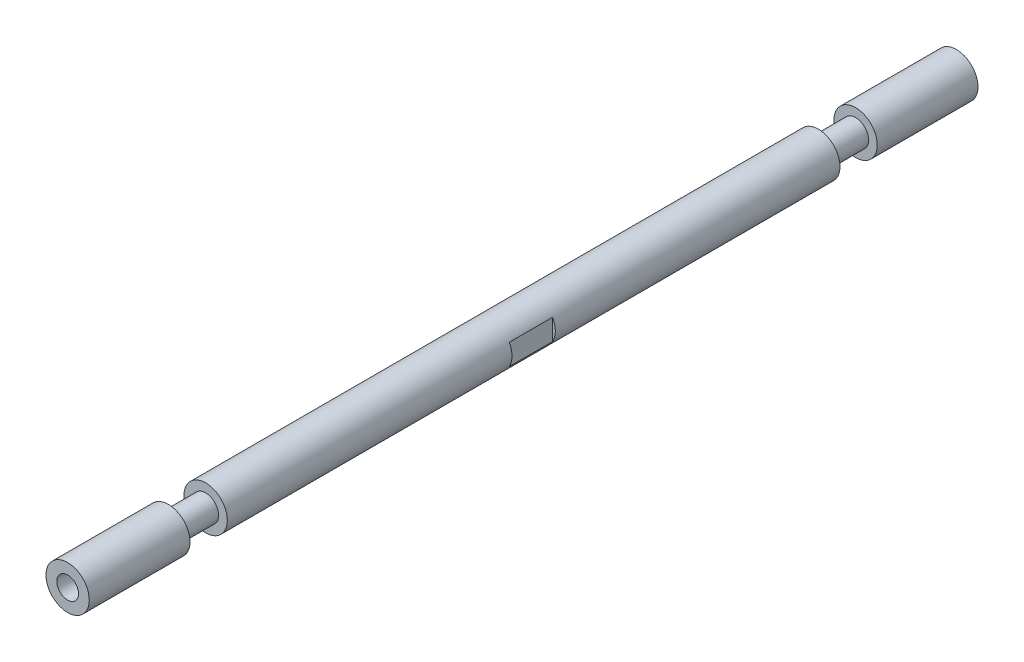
ISO-10303-21;
HEADER;
FILE_DESCRIPTION(('STEP AP214'),'2;1');
FILE_NAME('part.step','',(''),(''),'','','');
FILE_SCHEMA(('AUTOMOTIVE_DESIGN { 1 0 10303 214 1 1 1 1 }'));
ENDSEC;
DATA;
#1=APPLICATION_CONTEXT('core data for automotive mechanical design processes');
#2=APPLICATION_PROTOCOL_DEFINITION('international standard','automotive_design',2000,#1);
#3=PRODUCT_CONTEXT('',#1,'mechanical');
#4=PRODUCT('Part','Part','',(#3));
#5=PRODUCT_RELATED_PRODUCT_CATEGORY('part','',(#4));
#6=PRODUCT_DEFINITION_FORMATION('','',#4);
#7=PRODUCT_DEFINITION_CONTEXT('part definition',#1,'design');
#8=PRODUCT_DEFINITION('design','',#6,#7);
#9=PRODUCT_DEFINITION_SHAPE('','',#8);
#10=(LENGTH_UNIT() NAMED_UNIT(*) SI_UNIT(.MILLI.,.METRE.));
#11=(NAMED_UNIT(*) PLANE_ANGLE_UNIT() SI_UNIT($,.RADIAN.));
#12=(NAMED_UNIT(*) SI_UNIT($,.STERADIAN.) SOLID_ANGLE_UNIT());
#13=UNCERTAINTY_MEASURE_WITH_UNIT(LENGTH_MEASURE(1.E-05),#10,'distance_accuracy_value','');
#14=(GEOMETRIC_REPRESENTATION_CONTEXT(3) GLOBAL_UNCERTAINTY_ASSIGNED_CONTEXT((#13)) GLOBAL_UNIT_ASSIGNED_CONTEXT((#10,
#11,#12)) REPRESENTATION_CONTEXT('',''));
#15=CARTESIAN_POINT('',(0.,0.,0.));
#16=DIRECTION('',(0.,0.,1.));
#17=DIRECTION('',(1.,0.,0.));
#18=AXIS2_PLACEMENT_3D('',#15,#16,#17);
#19=CARTESIAN_POINT('',(0.,0.,260.477));
#20=DIRECTION('',(0.,0.,-1.));
#21=DIRECTION('',(-1.,0.,0.));
#22=AXIS2_PLACEMENT_3D('',#19,#20,#21);
#23=CYLINDRICAL_SURFACE('',#22,6.35);
#24=CARTESIAN_POINT('',(0.,0.,40.4495));
#25=DIRECTION('',(0.,0.,-1.));
#26=DIRECTION('',(-1.,0.,0.));
#27=AXIS2_PLACEMENT_3D('',#24,#25,#26);
#28=CIRCLE('',#27,6.35);
#29=CARTESIAN_POINT('',(-6.35,0.,40.4495));
#30=VERTEX_POINT('',#29);
#31=EDGE_CURVE('E108',#30,#30,#28,.T.);
#32=ORIENTED_EDGE('',*,*,#31,.F.);
#33=EDGE_LOOP('',(#32));
#34=FACE_BOUND('',#33,.T.);
#35=CARTESIAN_POINT('',(0.,0.,220.0275));
#36=DIRECTION('',(0.,0.,1.));
#37=DIRECTION('',(1.,0.,0.));
#38=AXIS2_PLACEMENT_3D('',#35,#36,#37);
#39=CIRCLE('',#38,6.35);
#40=CARTESIAN_POINT('',(6.35,0.,220.0275));
#41=VERTEX_POINT('',#40);
#42=EDGE_CURVE('E116',#41,#41,#39,.T.);
#43=ORIENTED_EDGE('',*,*,#42,.F.);
#44=EDGE_LOOP('',(#43));
#45=FACE_BOUND('',#44,.T.);
#46=CARTESIAN_POINT('',(0.,0.,123.8885));
#47=DIRECTION('',(0.,0.,-1.));
#48=DIRECTION('',(-1.,0.,0.));
#49=AXIS2_PLACEMENT_3D('',#46,#47,#48);
#50=CIRCLE('',#49,6.35);
#51=CARTESIAN_POINT('',(-5.54990000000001,-3.08562959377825,123.8885));
#52=VERTEX_POINT('',#51);
#53=CARTESIAN_POINT('',(-5.54990000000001,3.08562959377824,123.8885));
#54=VERTEX_POINT('',#53);
#55=EDGE_CURVE('E86',#52,#54,#50,.T.);
#56=ORIENTED_EDGE('',*,*,#55,.T.);
#57=DIRECTION('',(0.,0.,-1.));
#58=VECTOR('',#57,1.);
#59=CARTESIAN_POINT('',(-5.54989999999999,3.08562959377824,260.477));
#60=LINE('',#59,#58);
#61=CARTESIAN_POINT('',(-5.54990000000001,3.08562959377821,136.5885));
#62=VERTEX_POINT('',#61);
#63=EDGE_CURVE('E101',#54,#62,#60,.F.);
#64=ORIENTED_EDGE('',*,*,#63,.T.);
#65=CARTESIAN_POINT('',(0.,0.,136.5885));
#66=DIRECTION('',(0.,0.,1.));
#67=DIRECTION('',(1.,0.,0.));
#68=AXIS2_PLACEMENT_3D('',#65,#66,#67);
#69=CIRCLE('',#68,6.35);
#70=CARTESIAN_POINT('',(-5.54990000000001,-3.08562959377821,136.5885));
#71=VERTEX_POINT('',#70);
#72=EDGE_CURVE('E104',#62,#71,#69,.T.);
#73=ORIENTED_EDGE('',*,*,#72,.T.);
#74=DIRECTION('',(0.,0.,-1.));
#75=VECTOR('',#74,1.);
#76=CARTESIAN_POINT('',(-5.54989999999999,-3.08562959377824,260.477));
#77=LINE('',#76,#75);
#78=EDGE_CURVE('E98',#71,#52,#77,.T.);
#79=ORIENTED_EDGE('',*,*,#78,.T.);
#80=EDGE_LOOP('',(#56,#64,#73,#79));
#81=FACE_BOUND('',#80,.T.);
#82=CARTESIAN_POINT('',(0.,0.,136.5885));
#83=DIRECTION('',(0.,0.,-1.));
#84=DIRECTION('',(-1.,0.,0.));
#85=AXIS2_PLACEMENT_3D('',#82,#83,#84);
#86=CIRCLE('',#85,6.35);
#87=CARTESIAN_POINT('',(5.54990000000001,3.08562959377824,136.5885));
#88=VERTEX_POINT('',#87);
#89=CARTESIAN_POINT('',(5.54990000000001,-3.08562959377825,136.5885));
#90=VERTEX_POINT('',#89);
#91=EDGE_CURVE('E11',#88,#90,#86,.T.);
#92=ORIENTED_EDGE('',*,*,#91,.F.);
#93=DIRECTION('',(0.,0.,-1.));
#94=VECTOR('',#93,1.);
#95=CARTESIAN_POINT('',(5.54989999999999,3.08562959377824,260.477));
#96=LINE('',#95,#94);
#97=CARTESIAN_POINT('',(5.54990000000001,3.08562959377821,123.8885));
#98=VERTEX_POINT('',#97);
#99=EDGE_CURVE('E85',#98,#88,#96,.F.);
#100=ORIENTED_EDGE('',*,*,#99,.F.);
#101=CARTESIAN_POINT('',(0.,0.,123.8885));
#102=DIRECTION('',(0.,0.,1.));
#103=DIRECTION('',(1.,0.,0.));
#104=AXIS2_PLACEMENT_3D('',#101,#102,#103);
#105=CIRCLE('',#104,6.35);
#106=CARTESIAN_POINT('',(5.54990000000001,-3.08562959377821,123.8885));
#107=VERTEX_POINT('',#106);
#108=EDGE_CURVE('E80',#107,#98,#105,.T.);
#109=ORIENTED_EDGE('',*,*,#108,.F.);
#110=DIRECTION('',(0.,0.,-1.));
#111=VECTOR('',#110,1.);
#112=CARTESIAN_POINT('',(5.54989999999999,-3.08562959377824,260.477));
#113=LINE('',#112,#111);
#114=EDGE_CURVE('E44',#90,#107,#113,.T.);
#115=ORIENTED_EDGE('',*,*,#114,.F.);
#116=EDGE_LOOP('',(#92,#100,#109,#115));
#117=FACE_BOUND('',#116,.T.);
#118=ADVANCED_FACE('F36',(#34,#45,#81,#117),#23,.T.);
#119=CARTESIAN_POINT('',(0.,0.,260.477));
#120=DIRECTION('',(0.,0.,1.));
#121=DIRECTION('',(1.,0.,0.));
#122=AXIS2_PLACEMENT_3D('',#119,#120,#121);
#123=PLANE('',#122);
#124=CARTESIAN_POINT('',(0.,0.,260.477));
#125=DIRECTION('',(0.,0.,1.));
#126=DIRECTION('',(1.,0.,0.));
#127=AXIS2_PLACEMENT_3D('',#124,#125,#126);
#128=CIRCLE('',#127,6.35);
#129=CARTESIAN_POINT('',(6.35,0.,260.477));
#130=VERTEX_POINT('',#129);
#131=EDGE_CURVE('E107',#130,#130,#128,.T.);
#132=ORIENTED_EDGE('',*,*,#131,.T.);
#133=EDGE_LOOP('',(#132));
#134=FACE_BOUND('',#133,.T.);
#135=CARTESIAN_POINT('',(0.0144943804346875,0.00457175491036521,260.476999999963));
#136=DIRECTION('',(0.,0.,1.));
#137=DIRECTION('',(1.,0.,0.));
#138=AXIS2_PLACEMENT_3D('',#135,#136,#137);
#139=CIRCLE('',#138,3.17499725);
#140=CARTESIAN_POINT('',(3.18949163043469,0.00457175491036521,260.476999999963));
#141=VERTEX_POINT('',#140);
#142=EDGE_CURVE('E152',#141,#141,#139,.T.);
#143=ORIENTED_EDGE('',*,*,#142,.F.);
#144=EDGE_LOOP('',(#143));
#145=FACE_BOUND('',#144,.T.);
#146=ADVANCED_FACE('F172',(#134,#145),#123,.T.);
#147=CARTESIAN_POINT('',(0.,0.,0.));
#148=DIRECTION('',(0.,0.,1.));
#149=DIRECTION('',(1.,0.,0.));
#150=AXIS2_PLACEMENT_3D('',#147,#148,#149);
#151=PLANE('',#150);
#152=CARTESIAN_POINT('',(0.,0.,0.));
#153=DIRECTION('',(0.,0.,1.));
#154=DIRECTION('',(1.,0.,0.));
#155=AXIS2_PLACEMENT_3D('',#152,#153,#154);
#156=CIRCLE('',#155,6.35);
#157=CARTESIAN_POINT('',(6.35,0.,0.));
#158=VERTEX_POINT('',#157);
#159=EDGE_CURVE('E119',#158,#158,#156,.T.);
#160=ORIENTED_EDGE('',*,*,#159,.F.);
#161=EDGE_LOOP('',(#160));
#162=FACE_BOUND('',#161,.T.);
#163=CARTESIAN_POINT('',(0.00308593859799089,-0.0113117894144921,-5.6841865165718E-11));
#164=DIRECTION('',(0.,0.,-1.));
#165=DIRECTION('',(-1.,0.,0.));
#166=AXIS2_PLACEMENT_3D('',#163,#164,#165);
#167=CIRCLE('',#166,2.552697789);
#168=CARTESIAN_POINT('',(-2.54961185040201,-0.0113117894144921,-5.6841865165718E-11));
#169=VERTEX_POINT('',#168);
#170=EDGE_CURVE('E140',#169,#169,#167,.T.);
#171=ORIENTED_EDGE('',*,*,#170,.F.);
#172=EDGE_LOOP('',(#171));
#173=FACE_BOUND('',#172,.T.);
#174=ADVANCED_FACE('F178',(#162,#173),#151,.F.);
#175=CARTESIAN_POINT('',(0.,0.,220.0275));
#176=DIRECTION('',(0.,0.,1.));
#177=DIRECTION('',(1.,0.,0.));
#178=AXIS2_PLACEMENT_3D('',#175,#176,#177);
#179=PLANE('',#178);
#180=CARTESIAN_POINT('',(0.,0.,220.0275));
#181=DIRECTION('',(0.,0.,1.));
#182=DIRECTION('',(1.,0.,0.));
#183=AXIS2_PLACEMENT_3D('',#180,#181,#182);
#184=CIRCLE('',#183,3.81);
#185=CARTESIAN_POINT('',(3.81,0.,220.0275));
#186=VERTEX_POINT('',#185);
#187=EDGE_CURVE('E123',#186,#186,#184,.T.);
#188=ORIENTED_EDGE('',*,*,#187,.F.);
#189=EDGE_LOOP('',(#188));
#190=FACE_BOUND('',#189,.T.);
#191=ORIENTED_EDGE('',*,*,#42,.T.);
#192=EDGE_LOOP('',(#191));
#193=FACE_BOUND('',#192,.T.);
#194=ADVANCED_FACE('F247',(#190,#193),#179,.T.);
#195=CARTESIAN_POINT('',(0.,0.,230.9495));
#196=DIRECTION('',(0.,0.,1.));
#197=DIRECTION('',(1.,0.,0.));
#198=AXIS2_PLACEMENT_3D('',#195,#196,#197);
#199=PLANE('',#198);
#200=CARTESIAN_POINT('',(0.,0.,230.9495));
#201=DIRECTION('',(0.,0.,1.));
#202=DIRECTION('',(1.,0.,0.));
#203=AXIS2_PLACEMENT_3D('',#200,#201,#202);
#204=CIRCLE('',#203,3.81);
#205=CARTESIAN_POINT('',(3.81,0.,230.9495));
#206=VERTEX_POINT('',#205);
#207=EDGE_CURVE('E111',#206,#206,#204,.T.);
#208=ORIENTED_EDGE('',*,*,#207,.T.);
#209=EDGE_LOOP('',(#208));
#210=FACE_BOUND('',#209,.T.);
#211=CARTESIAN_POINT('',(0.,0.,230.9495));
#212=DIRECTION('',(0.,0.,1.));
#213=DIRECTION('',(1.,0.,0.));
#214=AXIS2_PLACEMENT_3D('',#211,#212,#213);
#215=CIRCLE('',#214,6.35);
#216=CARTESIAN_POINT('',(6.35,0.,230.9495));
#217=VERTEX_POINT('',#216);
#218=EDGE_CURVE('E120',#217,#217,#215,.T.);
#219=ORIENTED_EDGE('',*,*,#218,.F.);
#220=EDGE_LOOP('',(#219));
#221=FACE_BOUND('',#220,.T.);
#222=ADVANCED_FACE('F197',(#210,#221),#199,.F.);
#223=CARTESIAN_POINT('',(0.,0.,220.0275));
#224=DIRECTION('',(0.,0.,1.));
#225=DIRECTION('',(1.,0.,0.));
#226=AXIS2_PLACEMENT_3D('',#223,#224,#225);
#227=CYLINDRICAL_SURFACE('',#226,3.81);
#228=ORIENTED_EDGE('',*,*,#187,.T.);
#229=EDGE_LOOP('',(#228));
#230=FACE_BOUND('',#229,.T.);
#231=ORIENTED_EDGE('',*,*,#207,.F.);
#232=EDGE_LOOP('',(#231));
#233=FACE_BOUND('',#232,.T.);
#234=ADVANCED_FACE('F188',(#230,#233),#227,.T.);
#235=ORIENTED_EDGE('',*,*,#218,.T.);
#236=EDGE_LOOP('',(#235));
#237=FACE_BOUND('',#236,.T.);
#238=ORIENTED_EDGE('',*,*,#131,.F.);
#239=EDGE_LOOP('',(#238));
#240=FACE_BOUND('',#239,.T.);
#241=ADVANCED_FACE('F38',(#237,#240),#23,.T.);
#242=CARTESIAN_POINT('',(0.,0.,40.4495));
#243=DIRECTION('',(0.,0.,-1.));
#244=DIRECTION('',(-1.,0.,0.));
#245=AXIS2_PLACEMENT_3D('',#242,#243,#244);
#246=PLANE('',#245);
#247=CARTESIAN_POINT('',(0.,0.,40.4495));
#248=DIRECTION('',(0.,0.,-1.));
#249=DIRECTION('',(-1.,0.,0.));
#250=AXIS2_PLACEMENT_3D('',#247,#248,#249);
#251=CIRCLE('',#250,3.82990044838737);
#252=CARTESIAN_POINT('',(-3.82990044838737,0.,40.4495));
#253=VERTEX_POINT('',#252);
#254=EDGE_CURVE('E115',#253,#253,#251,.T.);
#255=ORIENTED_EDGE('',*,*,#254,.F.);
#256=EDGE_LOOP('',(#255));
#257=FACE_BOUND('',#256,.T.);
#258=ORIENTED_EDGE('',*,*,#31,.T.);
#259=EDGE_LOOP('',(#258));
#260=FACE_BOUND('',#259,.T.);
#261=ADVANCED_FACE('F187',(#257,#260),#246,.T.);
#262=CARTESIAN_POINT('',(0.,0.,29.5275));
#263=DIRECTION('',(0.,0.,-1.));
#264=DIRECTION('',(-1.,0.,0.));
#265=AXIS2_PLACEMENT_3D('',#262,#263,#264);
#266=PLANE('',#265);
#267=CARTESIAN_POINT('',(0.,0.,29.5275));
#268=DIRECTION('',(0.,0.,-1.));
#269=DIRECTION('',(-1.,0.,0.));
#270=AXIS2_PLACEMENT_3D('',#267,#268,#269);
#271=CIRCLE('',#270,3.82990044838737);
#272=CARTESIAN_POINT('',(-3.82990044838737,0.,29.5275));
#273=VERTEX_POINT('',#272);
#274=EDGE_CURVE('E134',#273,#273,#271,.T.);
#275=ORIENTED_EDGE('',*,*,#274,.T.);
#276=EDGE_LOOP('',(#275));
#277=FACE_BOUND('',#276,.T.);
#278=CARTESIAN_POINT('',(0.,0.,29.5275));
#279=DIRECTION('',(0.,0.,-1.));
#280=DIRECTION('',(-1.,0.,0.));
#281=AXIS2_PLACEMENT_3D('',#278,#279,#280);
#282=CIRCLE('',#281,6.35);
#283=CARTESIAN_POINT('',(-6.35,0.,29.5275));
#284=VERTEX_POINT('',#283);
#285=EDGE_CURVE('E112',#284,#284,#282,.T.);
#286=ORIENTED_EDGE('',*,*,#285,.F.);
#287=EDGE_LOOP('',(#286));
#288=FACE_BOUND('',#287,.T.);
#289=ADVANCED_FACE('F194',(#277,#288),#266,.F.);
#290=CARTESIAN_POINT('',(0.,0.,40.4495));
#291=DIRECTION('',(0.,0.,-1.));
#292=DIRECTION('',(-1.,0.,0.));
#293=AXIS2_PLACEMENT_3D('',#290,#291,#292);
#294=CYLINDRICAL_SURFACE('',#293,3.82990044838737);
#295=ORIENTED_EDGE('',*,*,#254,.T.);
#296=EDGE_LOOP('',(#295));
#297=FACE_BOUND('',#296,.T.);
#298=ORIENTED_EDGE('',*,*,#274,.F.);
#299=EDGE_LOOP('',(#298));
#300=FACE_BOUND('',#299,.T.);
#301=ADVANCED_FACE('F184',(#297,#300),#294,.T.);
#302=ORIENTED_EDGE('',*,*,#285,.T.);
#303=EDGE_LOOP('',(#302));
#304=FACE_BOUND('',#303,.T.);
#305=ORIENTED_EDGE('',*,*,#159,.T.);
#306=EDGE_LOOP('',(#305));
#307=FACE_BOUND('',#306,.T.);
#308=ADVANCED_FACE('F174',(#304,#307),#23,.T.);
#309=CARTESIAN_POINT('',(0.00308593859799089,-0.0113117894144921,25.3999779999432));
#310=DIRECTION('',(0.,0.,-1.));
#311=DIRECTION('',(-1.,0.,0.));
#312=AXIS2_PLACEMENT_3D('',#309,#310,#311);
#313=CONICAL_SURFACE('',#312,0.,1.0297443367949);
#314=CARTESIAN_POINT('',(0.00308593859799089,-0.0113117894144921,23.8661626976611));
#315=DIRECTION('',(0.,0.,-1.));
#316=DIRECTION('',(-1.,0.,0.));
#317=AXIS2_PLACEMENT_3D('',#314,#315,#316);
#318=CIRCLE('',#317,2.552697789);
#319=CARTESIAN_POINT('',(-2.54961185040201,-0.0113117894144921,23.8661626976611));
#320=VERTEX_POINT('',#319);
#321=EDGE_CURVE('E137',#320,#320,#318,.T.);
#322=ORIENTED_EDGE('',*,*,#321,.T.);
#323=EDGE_LOOP('',(#322));
#324=FACE_BOUND('',#323,.T.);
#325=CARTESIAN_POINT('',(0.00308593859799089,-0.0113117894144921,25.3999779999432));
#326=VERTEX_POINT('',#325);
#327=VERTEX_LOOP('',#326);
#328=FACE_BOUND('',#327,.T.);
#329=ADVANCED_FACE('F183',(#324,#328),#313,.F.);
#330=CARTESIAN_POINT('',(0.00308593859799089,-0.0113117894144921,-5.6843418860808E-11));
#331=DIRECTION('',(0.,0.,-1.));
#332=DIRECTION('',(-1.,0.,0.));
#333=AXIS2_PLACEMENT_3D('',#330,#331,#332);
#334=CYLINDRICAL_SURFACE('',#333,2.552697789);
#335=ORIENTED_EDGE('',*,*,#170,.T.);
#336=EDGE_LOOP('',(#335));
#337=FACE_BOUND('',#336,.T.);
#338=ORIENTED_EDGE('',*,*,#321,.F.);
#339=EDGE_LOOP('',(#338));
#340=FACE_BOUND('',#339,.T.);
#341=ADVANCED_FACE('F228',(#337,#340),#334,.F.);
#342=CARTESIAN_POINT('',(0.0144943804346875,0.00457175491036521,247.777010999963));
#343=DIRECTION('',(0.,0.,1.));
#344=DIRECTION('',(1.,0.,0.));
#345=AXIS2_PLACEMENT_3D('',#342,#343,#344);
#346=CONICAL_SURFACE('',#345,0.,1.0297443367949);
#347=CARTESIAN_POINT('',(0.0144943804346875,0.00457175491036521,249.310826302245));
#348=DIRECTION('',(0.,0.,1.));
#349=DIRECTION('',(1.,0.,0.));
#350=AXIS2_PLACEMENT_3D('',#347,#348,#349);
#351=CIRCLE('',#350,2.552697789);
#352=CARTESIAN_POINT('',(2.56719216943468,0.00457175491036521,249.310826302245));
#353=VERTEX_POINT('',#352);
#354=EDGE_CURVE('E143',#353,#353,#351,.T.);
#355=ORIENTED_EDGE('',*,*,#354,.T.);
#356=EDGE_LOOP('',(#355));
#357=FACE_BOUND('',#356,.T.);
#358=CARTESIAN_POINT('',(0.0144943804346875,0.00457175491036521,247.777010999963));
#359=VERTEX_POINT('',#358);
#360=VERTEX_LOOP('',#359);
#361=FACE_BOUND('',#360,.T.);
#362=ADVANCED_FACE('F222',(#357,#361),#346,.F.);
#363=CARTESIAN_POINT('',(0.0144943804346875,0.00457175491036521,260.476999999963));
#364=DIRECTION('',(0.,0.,1.));
#365=DIRECTION('',(1.,0.,0.));
#366=AXIS2_PLACEMENT_3D('',#363,#364,#365);
#367=CYLINDRICAL_SURFACE('',#366,2.552697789);
#368=CARTESIAN_POINT('',(0.0144943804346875,0.00457175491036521,249.047009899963));
#369=DIRECTION('',(0.,0.,1.));
#370=DIRECTION('',(1.,0.,0.));
#371=AXIS2_PLACEMENT_3D('',#368,#369,#370);
#372=CIRCLE('',#371,2.552697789);
#373=CARTESIAN_POINT('',(2.56719216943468,0.00457175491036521,249.047009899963));
#374=VERTEX_POINT('',#373);
#375=EDGE_CURVE('E146',#374,#374,#372,.T.);
#376=ORIENTED_EDGE('',*,*,#375,.T.);
#377=EDGE_LOOP('',(#376));
#378=FACE_BOUND('',#377,.T.);
#379=ORIENTED_EDGE('',*,*,#354,.F.);
#380=EDGE_LOOP('',(#379));
#381=FACE_BOUND('',#380,.T.);
#382=ADVANCED_FACE('F216',(#378,#381),#367,.T.);
#383=CARTESIAN_POINT('',(2.56719216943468,0.00457175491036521,249.047009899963));
#384=DIRECTION('',(0.,0.,1.));
#385=DIRECTION('',(1.,0.,0.));
#386=AXIS2_PLACEMENT_3D('',#383,#384,#385);
#387=PLANE('',#386);
#388=CARTESIAN_POINT('',(0.0144943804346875,0.00457175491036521,249.047009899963));
#389=DIRECTION('',(0.,0.,1.));
#390=DIRECTION('',(1.,0.,0.));
#391=AXIS2_PLACEMENT_3D('',#388,#389,#390);
#392=CIRCLE('',#391,3.17499725);
#393=CARTESIAN_POINT('',(3.18949163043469,0.00457175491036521,249.047009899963));
#394=VERTEX_POINT('',#393);
#395=EDGE_CURVE('E149',#394,#394,#392,.T.);
#396=ORIENTED_EDGE('',*,*,#395,.T.);
#397=EDGE_LOOP('',(#396));
#398=FACE_BOUND('',#397,.T.);
#399=ORIENTED_EDGE('',*,*,#375,.F.);
#400=EDGE_LOOP('',(#399));
#401=FACE_BOUND('',#400,.T.);
#402=ADVANCED_FACE('F210',(#398,#401),#387,.T.);
#403=CARTESIAN_POINT('',(0.0144943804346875,0.00457175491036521,260.476999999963));
#404=DIRECTION('',(0.,0.,1.));
#405=DIRECTION('',(1.,0.,0.));
#406=AXIS2_PLACEMENT_3D('',#403,#404,#405);
#407=CYLINDRICAL_SURFACE('',#406,3.17499725);
#408=ORIENTED_EDGE('',*,*,#142,.T.);
#409=EDGE_LOOP('',(#408));
#410=FACE_BOUND('',#409,.T.);
#411=ORIENTED_EDGE('',*,*,#395,.F.);
#412=EDGE_LOOP('',(#411));
#413=FACE_BOUND('',#412,.T.);
#414=ADVANCED_FACE('F206',(#410,#413),#407,.F.);
#415=CARTESIAN_POINT('',(-6.35000000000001,-12.7,123.8885));
#416=DIRECTION('',(0.,0.,-1.));
#417=DIRECTION('',(-1.,0.,0.));
#418=AXIS2_PLACEMENT_3D('',#415,#416,#417);
#419=PLANE('',#418);
#420=ORIENTED_EDGE('',*,*,#55,.F.);
#421=DIRECTION('',(0.,1.,0.));
#422=VECTOR('',#421,1.);
#423=CARTESIAN_POINT('',(-5.54990000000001,-12.7,123.8885));
#424=LINE('',#423,#422);
#425=EDGE_CURVE('E155',#52,#54,#424,.T.);
#426=ORIENTED_EDGE('',*,*,#425,.T.);
#427=EDGE_LOOP('',(#420,#426));
#428=FACE_BOUND('',#427,.T.);
#429=ADVANCED_FACE('F209',(#428),#419,.F.);
#430=CARTESIAN_POINT('',(-5.54990000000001,-12.7,123.8885));
#431=DIRECTION('',(1.,0.,0.));
#432=DIRECTION('',(0.,0.,-1.));
#433=AXIS2_PLACEMENT_3D('',#430,#431,#432);
#434=PLANE('',#433);
#435=DIRECTION('',(0.,1.,0.));
#436=VECTOR('',#435,1.);
#437=CARTESIAN_POINT('',(-5.54990000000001,-12.7,136.5885));
#438=LINE('',#437,#436);
#439=EDGE_CURVE('E57',#71,#62,#438,.T.);
#440=ORIENTED_EDGE('',*,*,#439,.T.);
#441=ORIENTED_EDGE('',*,*,#63,.F.);
#442=ORIENTED_EDGE('',*,*,#425,.F.);
#443=ORIENTED_EDGE('',*,*,#78,.F.);
#444=EDGE_LOOP('',(#440,#441,#442,#443));
#445=FACE_BOUND('',#444,.T.);
#446=ADVANCED_FACE('F169',(#445),#434,.F.);
#447=CARTESIAN_POINT('',(-6.35000000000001,-12.7,136.5885));
#448=DIRECTION('',(0.,0.,1.));
#449=DIRECTION('',(1.,0.,0.));
#450=AXIS2_PLACEMENT_3D('',#447,#448,#449);
#451=PLANE('',#450);
#452=ORIENTED_EDGE('',*,*,#439,.F.);
#453=ORIENTED_EDGE('',*,*,#72,.F.);
#454=EDGE_LOOP('',(#452,#453));
#455=FACE_BOUND('',#454,.T.);
#456=ADVANCED_FACE('F162',(#455),#451,.F.);
#457=CARTESIAN_POINT('',(6.35000000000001,-12.7,136.5885));
#458=DIRECTION('',(0.,0.,-1.));
#459=DIRECTION('',(-1.,0.,0.));
#460=AXIS2_PLACEMENT_3D('',#457,#458,#459);
#461=PLANE('',#460);
#462=DIRECTION('',(0.,1.,0.));
#463=VECTOR('',#462,1.);
#464=CARTESIAN_POINT('',(5.54990000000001,-12.7,136.5885));
#465=LINE('',#464,#463);
#466=EDGE_CURVE('E93',#90,#88,#465,.T.);
#467=ORIENTED_EDGE('',*,*,#466,.T.);
#468=ORIENTED_EDGE('',*,*,#91,.T.);
#469=EDGE_LOOP('',(#467,#468));
#470=FACE_BOUND('',#469,.T.);
#471=ADVANCED_FACE('F160',(#470),#461,.T.);
#472=CARTESIAN_POINT('',(5.54990000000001,-12.7,123.8885));
#473=DIRECTION('',(1.,0.,0.));
#474=DIRECTION('',(0.,0.,-1.));
#475=AXIS2_PLACEMENT_3D('',#472,#473,#474);
#476=PLANE('',#475);
#477=ORIENTED_EDGE('',*,*,#114,.T.);
#478=DIRECTION('',(0.,1.,0.));
#479=VECTOR('',#478,1.);
#480=CARTESIAN_POINT('',(5.54990000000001,-12.7,123.8885));
#481=LINE('',#480,#479);
#482=EDGE_CURVE('E50',#107,#98,#481,.T.);
#483=ORIENTED_EDGE('',*,*,#482,.T.);
#484=ORIENTED_EDGE('',*,*,#99,.T.);
#485=ORIENTED_EDGE('',*,*,#466,.F.);
#486=EDGE_LOOP('',(#477,#483,#484,#485));
#487=FACE_BOUND('',#486,.T.);
#488=ADVANCED_FACE('F90',(#487),#476,.T.);
#489=CARTESIAN_POINT('',(6.35000000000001,-12.7,123.8885));
#490=DIRECTION('',(0.,0.,1.));
#491=DIRECTION('',(1.,0.,0.));
#492=AXIS2_PLACEMENT_3D('',#489,#490,#491);
#493=PLANE('',#492);
#494=ORIENTED_EDGE('',*,*,#108,.T.);
#495=ORIENTED_EDGE('',*,*,#482,.F.);
#496=EDGE_LOOP('',(#494,#495));
#497=FACE_BOUND('',#496,.T.);
#498=ADVANCED_FACE('F81',(#497),#493,.T.);
#499=CLOSED_SHELL('',(#118,#146,#174,#194,#222,#234,#241,#261,#289,#301,#308,#329,#341,#362,
#382,#402,#414,#429,#446,#456,#471,#488,#498));
#500=MANIFOLD_SOLID_BREP('B2',#499);
#501=ADVANCED_BREP_SHAPE_REPRESENTATION('',(#18,#500),#14);
#502=SHAPE_DEFINITION_REPRESENTATION(#9,#501);
ENDSEC;
END-ISO-10303-21;
